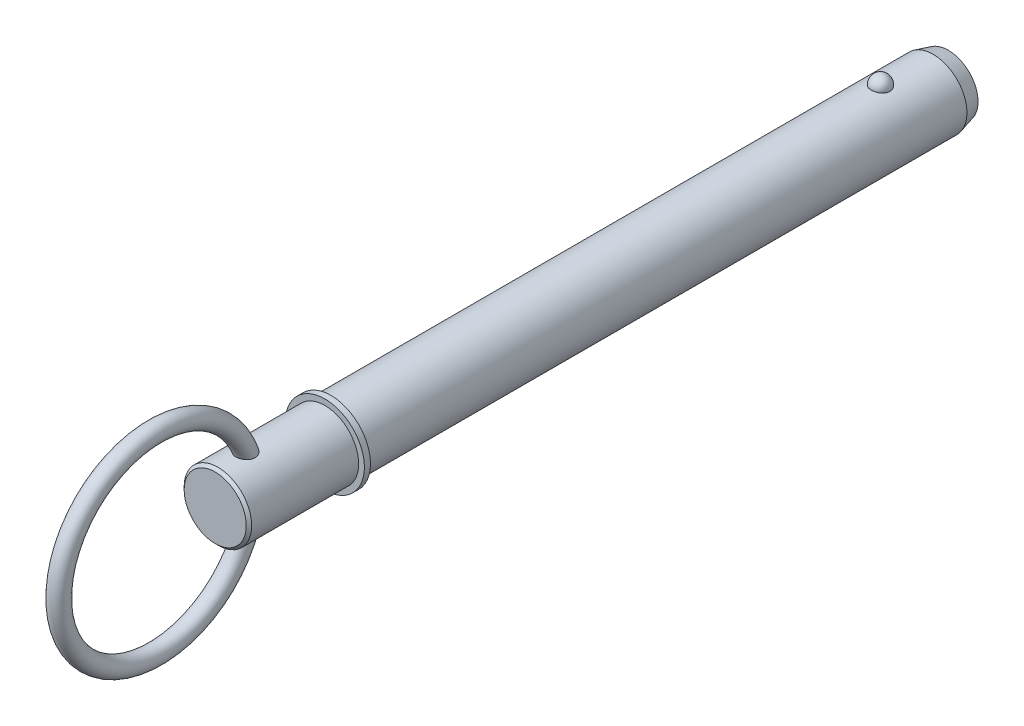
from build123d import *

# Parameters (mm, degrees)
SKETCH2_R           = 11.115
BOSS_EXTRUDE1_DEPTH = 177.8
BOSS_EXTRUDE2_START = 25.4
SKETCH3_R           = 11.115
BOSS_EXTRUDE2_DEPTH = 25.4
CHAMFER1_SIZE       = 5
CHAMFER1_SIZE2      = 1.339745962
SKETCH20_W          = 2
SKETCH20_H          = 13
SKETCH21_R          = 11.115
BOSS_EXTRUDE3_DEPTH = 38.1
CHAMFER2_SIZE       = 0.9
SKETCH24_R          = 3


with BuildPart() as part:
    # Sketch2 → Boss-Extrude1 (new body)
    with BuildSketch(Plane.XY):
        Circle(SKETCH2_R)
    extrude(amount=BOSS_EXTRUDE1_DEPTH)

    # Sketch3 → Boss-Extrude2 (add)
    with BuildSketch(Plane(origin=(0, 0, 0), x_dir=(-1, 0, 0), z_dir=(0, 0, -1)).offset(BOSS_EXTRUDE2_START)):
        Circle(SKETCH3_R)
    extrude(amount=-BOSS_EXTRUDE2_DEPTH)

    # Chamfer1
    chamfer1_edges = [part.edges().sort_by_distance(p)[0] for p in [
        (11.115, 0, -25.4),
    ]]
    chamfer1_side = [part.faces().sort_by_distance(p)[0] for p in [
        (11.115, 0, -12.7),
    ]]
    chamfer(chamfer1_edges, length=CHAMFER1_SIZE, length2=CHAMFER1_SIZE2, reference=chamfer1_side[0])

    # Sketch18 → Revolve1 (revolve)
    with BuildSketch(Plane(origin=(0, 0, 0), x_dir=(0, 0, -1), z_dir=(1, 0, 0))):
        with BuildLine():
            Line((3.07, 14.185), (3.07, 8.045))
            ThreePointArc((3.07, 8.045), (0, 11.115), (3.07, 14.185))
        make_face()
    revolve(axis=Axis((0, 14.185, -3.07), (0, -1, 0)))

    # Sketch20 → Revolve2 (revolve)
    with BuildSketch(Plane(origin=(0, 0, 0), x_dir=(0, 0, -1), z_dir=(1, 0, 0)), mode=Mode.PRIVATE) as revolve2_sk:
        with Locations((-178.8, 6.5)):
            Rectangle(SKETCH20_W, SKETCH20_H)
    revolve(revolve2_sk.sketch.rotate(Axis((0, 0, 33.728787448), (0, 0, 1)), 90), axis=Axis((0, 0, 33.728787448), (0, 0, 1)))

    # Sketch21 → Boss-Extrude3 (add)
    with BuildSketch(Plane(origin=(0, 0, 177.8), x_dir=(-1, 0, 0), z_dir=(0, 0, -1))):
        Circle(SKETCH21_R)
    extrude(amount=-BOSS_EXTRUDE3_DEPTH)

    # Chamfer2
    chamfer2_edges = [part.edges().sort_by_distance(p)[0] for p in [
        (11.115, 0, 215.9),
    ]]
    chamfer(chamfer2_edges, length=CHAMFER2_SIZE)

    # Sweep1: sweep along a path in Sketch23
    with BuildLine(Plane(origin=(0, 0, 0), x_dir=(0, 0, -1), z_dir=(1, 0, 0))) as sweep1_path:
        CenterArc((-235.65, 0), 31.75, 0, 360)
    # Sketch24 → Sweep1 (sweep)
    with BuildSketch(Plane(origin=(0, 0, 0), x_dir=(1, 0, 0), z_dir=(0, 1, 0))):
        with Locations((0, -203.9)):
            Circle(SKETCH24_R)
    sweep(path=sweep1_path.line)


solid = part.part
